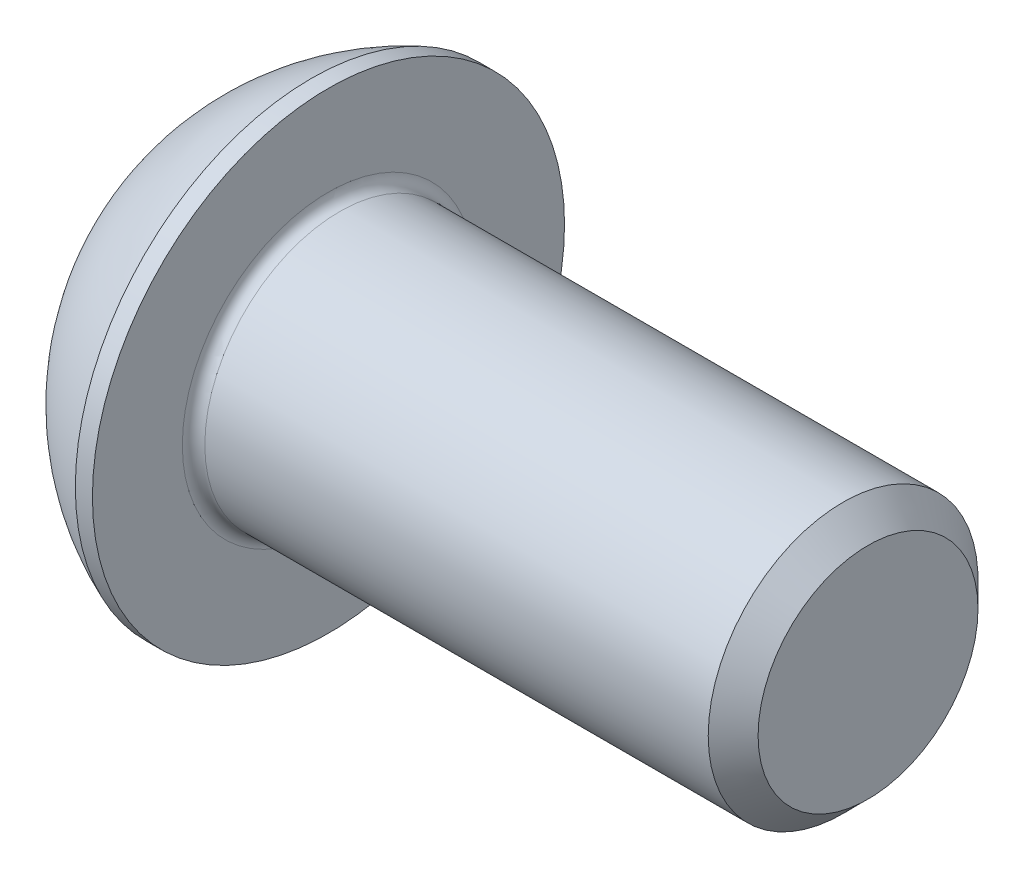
ISO-10303-21;
HEADER;
FILE_DESCRIPTION(('STEP AP214'),'2;1');
FILE_NAME('part.step','',(''),(''),'','','');
FILE_SCHEMA(('AUTOMOTIVE_DESIGN { 1 0 10303 214 1 1 1 1 }'));
ENDSEC;
DATA;
#1=APPLICATION_CONTEXT('core data for automotive mechanical design processes');
#2=APPLICATION_PROTOCOL_DEFINITION('international standard','automotive_design',2000,#1);
#3=PRODUCT_CONTEXT('',#1,'mechanical');
#4=PRODUCT('Part','Part','',(#3));
#5=PRODUCT_RELATED_PRODUCT_CATEGORY('part','',(#4));
#6=PRODUCT_DEFINITION_FORMATION('','',#4);
#7=PRODUCT_DEFINITION_CONTEXT('part definition',#1,'design');
#8=PRODUCT_DEFINITION('design','',#6,#7);
#9=PRODUCT_DEFINITION_SHAPE('','',#8);
#10=(LENGTH_UNIT() NAMED_UNIT(*) SI_UNIT(.MILLI.,.METRE.));
#11=(NAMED_UNIT(*) PLANE_ANGLE_UNIT() SI_UNIT($,.RADIAN.));
#12=(NAMED_UNIT(*) SI_UNIT($,.STERADIAN.) SOLID_ANGLE_UNIT());
#13=UNCERTAINTY_MEASURE_WITH_UNIT(LENGTH_MEASURE(1.E-05),#10,'distance_accuracy_value','');
#14=(GEOMETRIC_REPRESENTATION_CONTEXT(3) GLOBAL_UNCERTAINTY_ASSIGNED_CONTEXT((#13)) GLOBAL_UNIT_ASSIGNED_CONTEXT((#10,
#11,#12)) REPRESENTATION_CONTEXT('',''));
#15=CARTESIAN_POINT('',(0.,0.,0.));
#16=DIRECTION('',(0.,0.,1.));
#17=DIRECTION('',(1.,0.,0.));
#18=AXIS2_PLACEMENT_3D('',#15,#16,#17);
#19=CARTESIAN_POINT('',(0.,0.,0.));
#20=DIRECTION('',(-1.,0.,0.));
#21=DIRECTION('',(0.,0.,1.));
#22=AXIS2_PLACEMENT_3D('',#19,#20,#21);
#23=PLANE('',#22);
#24=CARTESIAN_POINT('',(0.,0.,0.));
#25=DIRECTION('',(-1.,0.,0.));
#26=DIRECTION('',(0.,0.,1.));
#27=AXIS2_PLACEMENT_3D('',#24,#25,#26);
#28=CIRCLE('',#27,2.625);
#29=CARTESIAN_POINT('',(0.,2.625,0.));
#30=VERTEX_POINT('',#29);
#31=EDGE_CURVE('E156',#30,#30,#28,.T.);
#32=ORIENTED_EDGE('',*,*,#31,.T.);
#33=EDGE_LOOP('',(#32));
#34=FACE_BOUND('',#33,.T.);
#35=DIRECTION('',(0.,-1.,0.));
#36=VECTOR('',#35,1.);
#37=CARTESIAN_POINT('',(0.,-1.15470053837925,2.));
#38=LINE('',#37,#36);
#39=CARTESIAN_POINT('',(0.,1.15470053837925,2.));
#40=VERTEX_POINT('',#39);
#41=CARTESIAN_POINT('',(0.,-1.15470053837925,2.));
#42=VERTEX_POINT('',#41);
#43=EDGE_CURVE('E51',#40,#42,#38,.T.);
#44=ORIENTED_EDGE('',*,*,#43,.T.);
#45=DIRECTION('',(0.,-0.499999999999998,-0.86602540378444));
#46=VECTOR('',#45,1.);
#47=CARTESIAN_POINT('',(0.,-2.3094010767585,0.));
#48=LINE('',#47,#46);
#49=CARTESIAN_POINT('',(0.,-2.3094010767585,0.));
#50=VERTEX_POINT('',#49);
#51=EDGE_CURVE('E276',#42,#50,#48,.T.);
#52=ORIENTED_EDGE('',*,*,#51,.T.);
#53=DIRECTION('',(0.,0.499999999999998,-0.86602540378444));
#54=VECTOR('',#53,1.);
#55=CARTESIAN_POINT('',(0.,-1.15470053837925,-2.));
#56=LINE('',#55,#54);
#57=CARTESIAN_POINT('',(0.,-1.15470053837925,-2.));
#58=VERTEX_POINT('',#57);
#59=EDGE_CURVE('E131',#50,#58,#56,.T.);
#60=ORIENTED_EDGE('',*,*,#59,.T.);
#61=DIRECTION('',(0.,1.,0.));
#62=VECTOR('',#61,1.);
#63=CARTESIAN_POINT('',(0.,1.15470053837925,-2.));
#64=LINE('',#63,#62);
#65=CARTESIAN_POINT('',(0.,1.15470053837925,-2.));
#66=VERTEX_POINT('',#65);
#67=EDGE_CURVE('E279',#58,#66,#64,.T.);
#68=ORIENTED_EDGE('',*,*,#67,.T.);
#69=DIRECTION('',(0.,0.499999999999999,0.866025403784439));
#70=VECTOR('',#69,1.);
#71=CARTESIAN_POINT('',(0.,2.3094010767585,0.));
#72=LINE('',#71,#70);
#73=CARTESIAN_POINT('',(0.,2.3094010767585,0.));
#74=VERTEX_POINT('',#73);
#75=EDGE_CURVE('E281',#66,#74,#72,.T.);
#76=ORIENTED_EDGE('',*,*,#75,.T.);
#77=DIRECTION('',(0.,-0.499999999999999,0.866025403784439));
#78=VECTOR('',#77,1.);
#79=CARTESIAN_POINT('',(0.,1.15470053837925,2.));
#80=LINE('',#79,#78);
#81=EDGE_CURVE('E283',#74,#40,#80,.T.);
#82=ORIENTED_EDGE('',*,*,#81,.T.);
#83=EDGE_LOOP('',(#44,#52,#60,#68,#76,#82));
#84=FACE_BOUND('',#83,.T.);
#85=ADVANCED_FACE('F36',(#34,#84),#23,.T.);
#86=CARTESIAN_POINT('',(4.99970462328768,0.,0.));
#87=DIRECTION('',(-1.,0.,0.));
#88=DIRECTION('',(0.,1.,0.));
#89=AXIS2_PLACEMENT_3D('',#86,#87,#88);
#90=SPHERICAL_SURFACE('',#89,5.64691697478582);
#91=CARTESIAN_POINT('',(2.92,0.,0.));
#92=DIRECTION('',(-1.,0.,0.));
#93=DIRECTION('',(0.,0.,1.));
#94=AXIS2_PLACEMENT_3D('',#91,#92,#93);
#95=CIRCLE('',#94,5.25);
#96=CARTESIAN_POINT('',(2.92,5.25,0.));
#97=VERTEX_POINT('',#96);
#98=EDGE_CURVE('E153',#97,#97,#95,.T.);
#99=CARTESIAN_POINT('',(2.92,5.25,0.));
#100=CARTESIAN_POINT('',(2.88116333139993,5.23461555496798,0.));
#101=CARTESIAN_POINT('',(2.84249743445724,5.21880002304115,0.));
#102=CARTESIAN_POINT('',(2.76552608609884,5.18631490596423,0.));
#103=CARTESIAN_POINT('',(2.72722063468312,5.16964532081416,0.));
#104=CARTESIAN_POINT('',(2.65098907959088,5.13546021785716,0.));
#105=CARTESIAN_POINT('',(2.61306297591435,5.11794470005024,0.));
#106=CARTESIAN_POINT('',(2.5376087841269,5.08207638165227,0.));
#107=CARTESIAN_POINT('',(2.50008069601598,5.06372358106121,0.));
#108=CARTESIAN_POINT('',(2.42544101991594,5.02618972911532,0.));
#109=CARTESIAN_POINT('',(2.38832943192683,5.00700867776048,0.));
#110=CARTESIAN_POINT('',(2.31454103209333,4.9678277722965,0.));
#111=CARTESIAN_POINT('',(2.27786422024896,4.94782791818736,0.));
#112=CARTESIAN_POINT('',(2.204963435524,4.90701925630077,0.));
#113=CARTESIAN_POINT('',(2.16873946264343,4.88621044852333,0.));
#114=CARTESIAN_POINT('',(2.09676219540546,4.84379412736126,0.));
#115=CARTESIAN_POINT('',(2.06100890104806,4.82218661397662,0.));
#116=CARTESIAN_POINT('',(1.9899905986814,4.77818352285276,0.));
#117=CARTESIAN_POINT('',(1.95472559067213,4.75578794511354,0.));
#118=CARTESIAN_POINT('',(1.88470122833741,4.71021975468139,0.));
#119=CARTESIAN_POINT('',(1.84994187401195,4.68704714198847,0.));
#120=CARTESIAN_POINT('',(1.78094593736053,4.63993629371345,0.));
#121=CARTESIAN_POINT('',(1.74670935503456,4.61599805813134,0.));
#122=CARTESIAN_POINT('',(1.67877582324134,4.56736775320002,0.));
#123=CARTESIAN_POINT('',(1.6450788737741,4.5426756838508,0.));
#124=CARTESIAN_POINT('',(1.57824120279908,4.4925498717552,0.));
#125=CARTESIAN_POINT('',(1.54510048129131,4.4671161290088,0.));
#126=CARTESIAN_POINT('',(1.4793915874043,4.4155194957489,0.));
#127=CARTESIAN_POINT('',(1.44682341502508,4.38935660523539,0.));
#128=CARTESIAN_POINT('',(1.3822756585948,4.33631456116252,0.));
#129=CARTESIAN_POINT('',(1.35029607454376,4.30943540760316,0.));
#130=CARTESIAN_POINT('',(1.28694124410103,4.2549740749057,0.));
#131=CARTESIAN_POINT('',(1.25556599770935,4.22739189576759,0.));
#132=CARTESIAN_POINT('',(1.19343529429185,4.17153809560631,0.));
#133=CARTESIAN_POINT('',(1.16267983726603,4.14326647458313,0.));
#134=CARTESIAN_POINT('',(1.10180385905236,4.0860477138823,0.));
#135=CARTESIAN_POINT('',(1.07168333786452,4.05710057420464,0.));
#136=CARTESIAN_POINT('',(1.01209206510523,3.99854503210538,0.));
#137=CARTESIAN_POINT('',(0.982621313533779,3.96893662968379,0.));
#138=CARTESIAN_POINT('',(0.924344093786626,3.90907314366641,0.));
#139=CARTESIAN_POINT('',(0.895537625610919,3.87881806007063,0.));
#140=CARTESIAN_POINT('',(0.838603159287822,3.8176761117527,0.));
#141=CARTESIAN_POINT('',(0.810475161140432,3.78678924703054,0.));
#142=CARTESIAN_POINT('',(0.754911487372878,3.72439894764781,0.));
#143=CARTESIAN_POINT('',(0.727475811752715,3.69289551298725,0.));
#144=CARTESIAN_POINT('',(0.673310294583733,3.62928758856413,0.));
#145=CARTESIAN_POINT('',(0.646580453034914,3.59718309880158,0.));
#146=CARTESIAN_POINT('',(0.593839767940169,3.53238887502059,0.));
#147=CARTESIAN_POINT('',(0.567828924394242,3.49969914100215,0.));
#148=CARTESIAN_POINT('',(0.516539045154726,3.43375052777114,0.));
#149=CARTESIAN_POINT('',(0.491260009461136,3.40049164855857,0.));
#150=CARTESIAN_POINT('',(0.441446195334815,3.33342112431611,0.));
#151=CARTESIAN_POINT('',(0.416911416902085,3.29960947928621,0.));
#152=CARTESIAN_POINT('',(0.368598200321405,3.23145007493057,0.));
#153=CARTESIAN_POINT('',(0.344819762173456,3.19710231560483,0.));
#154=CARTESIAN_POINT('',(0.298030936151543,3.12788759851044,0.));
#155=CARTESIAN_POINT('',(0.275020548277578,3.09302064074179,0.));
#156=CARTESIAN_POINT('',(0.229779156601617,3.02278469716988,0.));
#157=CARTESIAN_POINT('',(0.207548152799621,2.98741571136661,0.));
#158=CARTESIAN_POINT('',(0.163876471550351,2.91619313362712,0.));
#159=CARTESIAN_POINT('',(0.142435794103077,2.8803395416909,0.));
#160=CARTESIAN_POINT('',(0.100355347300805,2.80816539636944,0.));
#161=CARTESIAN_POINT('',(0.0797155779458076,2.7718448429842,0.));
#162=CARTESIAN_POINT('',(0.0392470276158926,2.69875470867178,0.));
#163=CARTESIAN_POINT('',(0.0194182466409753,2.66198512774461,0.));
#164=CARTESIAN_POINT('',(0.,2.625,0.));
#165=B_SPLINE_CURVE_WITH_KNOTS('',3,(#99,#100,#101,#102,#103,#104,#105,#106,#107,#108,#109,#110,
#111,#112,#113,#114,#115,#116,#117,#118,#119,#120,#121,#122,#123,#124,#125,#126,#127,#128,#129,
#130,#131,#132,#133,#134,#135,#136,#137,#138,#139,#140,#141,#142,#143,#144,#145,#146,#147,#148,
#149,#150,#151,#152,#153,#154,#155,#156,#157,#158,#159,#160,#161,#162,#163,#164),.UNSPECIFIED.,
.F.,.F.,(4,2,2,2,2,2,2,2,2,2,2,2,2,2,2,2,2,2,2,2,2,2,2,2,2,2,2,2,2,2,2,2,4),(0.,
0.12531586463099,0.25063172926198,0.37594759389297,0.501263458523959,0.626579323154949,
0.751895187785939,0.877211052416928,1.00252691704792,1.12784278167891,1.2531586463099,
1.37847451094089,1.50379037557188,1.62910624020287,1.75442210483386,1.87973796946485,
2.00505383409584,2.13036969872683,2.25568556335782,2.38100142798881,2.5063172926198,
2.63163315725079,2.75694902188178,2.88226488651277,3.00758075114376,3.13289661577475,
3.25821248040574,3.38352834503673,3.50884420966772,3.6341600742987,3.7594759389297,
3.88479180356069,4.01010766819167),.UNSPECIFIED.);
#166=EDGE_CURVE('BSEAM177',#97,#30,#165,.T.);
#167=ORIENTED_EDGE('',*,*,#98,.T.);
#168=ORIENTED_EDGE('',*,*,#31,.F.);
#169=ORIENTED_EDGE('',*,*,#166,.T.);
#170=ORIENTED_EDGE('',*,*,#166,.F.);
#171=EDGE_LOOP('',(#167,#169,#168,#170));
#172=FACE_BOUND('',#171,.T.);
#173=ADVANCED_FACE('F177',(#172),#90,.T.);
#174=CARTESIAN_POINT('',(0.,0.,0.));
#175=DIRECTION('',(-1.,0.,0.));
#176=DIRECTION('',(0.,0.,1.));
#177=AXIS2_PLACEMENT_3D('',#174,#175,#176);
#178=CYLINDRICAL_SURFACE('',#177,5.25);
#179=ORIENTED_EDGE('',*,*,#98,.F.);
#180=EDGE_LOOP('',(#179));
#181=FACE_BOUND('',#180,.T.);
#182=CARTESIAN_POINT('',(3.3,0.,0.));
#183=DIRECTION('',(-1.,0.,0.));
#184=DIRECTION('',(0.,0.,1.));
#185=AXIS2_PLACEMENT_3D('',#182,#183,#184);
#186=CIRCLE('',#185,5.25);
#187=CARTESIAN_POINT('',(3.3,0.,5.25));
#188=VERTEX_POINT('',#187);
#189=EDGE_CURVE('E150',#188,#188,#186,.T.);
#190=ORIENTED_EDGE('',*,*,#189,.T.);
#191=EDGE_LOOP('',(#190));
#192=FACE_BOUND('',#191,.T.);
#193=ADVANCED_FACE('F182',(#181,#192),#178,.T.);
#194=CARTESIAN_POINT('',(3.3,2.99999999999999,0.));
#195=DIRECTION('',(-1.,0.,0.));
#196=DIRECTION('',(0.,0.,1.));
#197=AXIS2_PLACEMENT_3D('',#194,#195,#196);
#198=PLANE('',#197);
#199=CARTESIAN_POINT('',(3.3,0.,0.));
#200=DIRECTION('',(-1.,0.,0.));
#201=DIRECTION('',(0.,0.,1.));
#202=AXIS2_PLACEMENT_3D('',#199,#200,#201);
#203=CIRCLE('',#202,3.24999999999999);
#204=CARTESIAN_POINT('',(3.3,0.,3.24999999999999));
#205=VERTEX_POINT('',#204);
#206=EDGE_CURVE('E44',#205,#205,#203,.T.);
#207=ORIENTED_EDGE('',*,*,#206,.T.);
#208=EDGE_LOOP('',(#207));
#209=FACE_BOUND('',#208,.T.);
#210=ORIENTED_EDGE('',*,*,#189,.F.);
#211=EDGE_LOOP('',(#210));
#212=FACE_BOUND('',#211,.T.);
#213=ADVANCED_FACE('F161',(#209,#212),#198,.F.);
#214=CARTESIAN_POINT('',(0.,0.,0.));
#215=DIRECTION('',(-1.,0.,0.));
#216=DIRECTION('',(0.,0.,1.));
#217=AXIS2_PLACEMENT_3D('',#214,#215,#216);
#218=CYLINDRICAL_SURFACE('',#217,2.99999999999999);
#219=CARTESIAN_POINT('',(3.55,0.,0.));
#220=DIRECTION('',(-1.,0.,0.));
#221=DIRECTION('',(0.,0.,1.));
#222=AXIS2_PLACEMENT_3D('',#219,#220,#221);
#223=CIRCLE('',#222,2.99999999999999);
#224=CARTESIAN_POINT('',(3.55,0.,2.99999999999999));
#225=VERTEX_POINT('',#224);
#226=EDGE_CURVE('E11',#225,#225,#223,.F.);
#227=ORIENTED_EDGE('',*,*,#226,.T.);
#228=EDGE_LOOP('',(#227));
#229=FACE_BOUND('',#228,.T.);
#230=CARTESIAN_POINT('',(14.7455,0.,0.));
#231=DIRECTION('',(-1.,0.,0.));
#232=DIRECTION('',(0.,0.,1.));
#233=AXIS2_PLACEMENT_3D('',#230,#231,#232);
#234=CIRCLE('',#233,3.);
#235=CARTESIAN_POINT('',(14.7455,0.,3.));
#236=VERTEX_POINT('',#235);
#237=EDGE_CURVE('E147',#236,#236,#234,.T.);
#238=ORIENTED_EDGE('',*,*,#237,.T.);
#239=EDGE_LOOP('',(#238));
#240=FACE_BOUND('',#239,.T.);
#241=ADVANCED_FACE('F191',(#229,#240),#218,.T.);
#242=CARTESIAN_POINT('',(15.3,0.,0.));
#243=DIRECTION('',(-1.,0.,0.));
#244=DIRECTION('',(0.,0.,1.));
#245=AXIS2_PLACEMENT_3D('',#242,#243,#244);
#246=CONICAL_SURFACE('',#245,2.4455,0.785398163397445);
#247=ORIENTED_EDGE('',*,*,#237,.F.);
#248=EDGE_LOOP('',(#247));
#249=FACE_BOUND('',#248,.T.);
#250=CARTESIAN_POINT('',(15.3,0.,0.));
#251=DIRECTION('',(-1.,0.,0.));
#252=DIRECTION('',(0.,0.,1.));
#253=AXIS2_PLACEMENT_3D('',#250,#251,#252);
#254=CIRCLE('',#253,2.4455);
#255=CARTESIAN_POINT('',(15.3,0.,2.4455));
#256=VERTEX_POINT('',#255);
#257=EDGE_CURVE('E143',#256,#256,#254,.T.);
#258=ORIENTED_EDGE('',*,*,#257,.T.);
#259=EDGE_LOOP('',(#258));
#260=FACE_BOUND('',#259,.T.);
#261=ADVANCED_FACE('F172',(#249,#260),#246,.T.);
#262=CARTESIAN_POINT('',(15.3,0.,0.));
#263=DIRECTION('',(-1.,0.,0.));
#264=DIRECTION('',(0.,0.,1.));
#265=AXIS2_PLACEMENT_3D('',#262,#263,#264);
#266=PLANE('',#265);
#267=ORIENTED_EDGE('',*,*,#257,.F.);
#268=EDGE_LOOP('',(#267));
#269=FACE_BOUND('',#268,.T.);
#270=ADVANCED_FACE('F165',(#269),#266,.F.);
#271=CARTESIAN_POINT('',(3.55,0.,0.));
#272=DIRECTION('',(-1.,0.,0.));
#273=DIRECTION('',(0.,0.,1.));
#274=AXIS2_PLACEMENT_3D('',#271,#272,#273);
#275=TOROIDAL_SURFACE('',#274,3.24999999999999,0.25);
#276=ORIENTED_EDGE('',*,*,#226,.F.);
#277=EDGE_LOOP('',(#276));
#278=FACE_BOUND('',#277,.T.);
#279=ORIENTED_EDGE('',*,*,#206,.F.);
#280=EDGE_LOOP('',(#279));
#281=FACE_BOUND('',#280,.T.);
#282=ADVANCED_FACE('F38',(#278,#281),#275,.F.);
#283=CARTESIAN_POINT('',(2.08,-2.3094010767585,0.));
#284=DIRECTION('',(0.,0.86602540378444,-0.499999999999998));
#285=DIRECTION('',(0.,0.499999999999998,0.86602540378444));
#286=AXIS2_PLACEMENT_3D('',#283,#284,#285);
#287=PLANE('',#286);
#288=DIRECTION('',(0.,-0.499999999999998,-0.86602540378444));
#289=VECTOR('',#288,1.);
#290=CARTESIAN_POINT('',(2.08,-2.3094010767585,0.));
#291=LINE('',#290,#289);
#292=CARTESIAN_POINT('',(2.08,-1.15470053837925,2.));
#293=VERTEX_POINT('',#292);
#294=CARTESIAN_POINT('',(2.08,-1.73205080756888,0.999999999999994));
#295=VERTEX_POINT('',#294);
#296=EDGE_CURVE('E117',#293,#295,#291,.T.);
#297=ORIENTED_EDGE('',*,*,#296,.T.);
#298=CARTESIAN_POINT('',(2.08,-2.3094010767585,0.));
#299=VERTEX_POINT('',#298);
#300=EDGE_CURVE('E112',#295,#299,#291,.T.);
#301=ORIENTED_EDGE('',*,*,#300,.T.);
#302=DIRECTION('',(-1.,0.,0.));
#303=VECTOR('',#302,1.);
#304=CARTESIAN_POINT('',(2.08,-2.3094010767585,0.));
#305=LINE('',#304,#303);
#306=EDGE_CURVE('E114',#299,#50,#305,.T.);
#307=ORIENTED_EDGE('',*,*,#306,.T.);
#308=ORIENTED_EDGE('',*,*,#51,.F.);
#309=DIRECTION('',(-1.,0.,0.));
#310=VECTOR('',#309,1.);
#311=CARTESIAN_POINT('',(2.08,-1.15470053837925,2.));
#312=LINE('',#311,#310);
#313=EDGE_CURVE('E272',#293,#42,#312,.T.);
#314=ORIENTED_EDGE('',*,*,#313,.F.);
#315=EDGE_LOOP('',(#297,#301,#307,#308,#314));
#316=FACE_BOUND('',#315,.T.);
#317=ADVANCED_FACE('F113',(#316),#287,.T.);
#318=CARTESIAN_POINT('',(2.08,-1.15470053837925,-2.));
#319=DIRECTION('',(0.,0.86602540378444,0.499999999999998));
#320=DIRECTION('',(0.,-0.499999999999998,0.86602540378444));
#321=AXIS2_PLACEMENT_3D('',#318,#319,#320);
#322=PLANE('',#321);
#323=DIRECTION('',(0.,0.499999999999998,-0.86602540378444));
#324=VECTOR('',#323,1.);
#325=CARTESIAN_POINT('',(2.08,-1.15470053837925,-2.));
#326=LINE('',#325,#324);
#327=CARTESIAN_POINT('',(2.08,-1.73205080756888,-0.999999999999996));
#328=VERTEX_POINT('',#327);
#329=EDGE_CURVE('E59',#299,#328,#326,.T.);
#330=ORIENTED_EDGE('',*,*,#329,.T.);
#331=CARTESIAN_POINT('',(2.08,-1.15470053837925,-2.));
#332=VERTEX_POINT('',#331);
#333=EDGE_CURVE('E126',#328,#332,#326,.T.);
#334=ORIENTED_EDGE('',*,*,#333,.T.);
#335=DIRECTION('',(-1.,0.,0.));
#336=VECTOR('',#335,1.);
#337=CARTESIAN_POINT('',(2.08,-1.15470053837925,-2.));
#338=LINE('',#337,#336);
#339=EDGE_CURVE('E133',#332,#58,#338,.T.);
#340=ORIENTED_EDGE('',*,*,#339,.T.);
#341=ORIENTED_EDGE('',*,*,#59,.F.);
#342=ORIENTED_EDGE('',*,*,#306,.F.);
#343=EDGE_LOOP('',(#330,#334,#340,#341,#342));
#344=FACE_BOUND('',#343,.T.);
#345=ADVANCED_FACE('F129',(#344),#322,.T.);
#346=CARTESIAN_POINT('',(2.08,1.15470053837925,-2.));
#347=DIRECTION('',(0.,0.,1.));
#348=DIRECTION('',(0.,-1.,0.));
#349=AXIS2_PLACEMENT_3D('',#346,#347,#348);
#350=PLANE('',#349);
#351=DIRECTION('',(0.,1.,0.));
#352=VECTOR('',#351,1.);
#353=CARTESIAN_POINT('',(2.08,1.15470053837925,-2.));
#354=LINE('',#353,#352);
#355=CARTESIAN_POINT('',(2.08,0.,-2.));
#356=VERTEX_POINT('',#355);
#357=EDGE_CURVE('E253',#332,#356,#354,.T.);
#358=ORIENTED_EDGE('',*,*,#357,.T.);
#359=CARTESIAN_POINT('',(2.08,1.15470053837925,-2.));
#360=VERTEX_POINT('',#359);
#361=EDGE_CURVE('E125',#356,#360,#354,.T.);
#362=ORIENTED_EDGE('',*,*,#361,.T.);
#363=DIRECTION('',(-1.,0.,0.));
#364=VECTOR('',#363,1.);
#365=CARTESIAN_POINT('',(2.08,1.15470053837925,-2.));
#366=LINE('',#365,#364);
#367=EDGE_CURVE('E138',#360,#66,#366,.T.);
#368=ORIENTED_EDGE('',*,*,#367,.T.);
#369=ORIENTED_EDGE('',*,*,#67,.F.);
#370=ORIENTED_EDGE('',*,*,#339,.F.);
#371=EDGE_LOOP('',(#358,#362,#368,#369,#370));
#372=FACE_BOUND('',#371,.T.);
#373=ADVANCED_FACE('F205',(#372),#350,.T.);
#374=CARTESIAN_POINT('',(2.08,2.3094010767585,0.));
#375=DIRECTION('',(0.,-0.866025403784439,0.499999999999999));
#376=DIRECTION('',(0.,-0.499999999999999,-0.866025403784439));
#377=AXIS2_PLACEMENT_3D('',#374,#375,#376);
#378=PLANE('',#377);
#379=DIRECTION('',(0.,0.499999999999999,0.866025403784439));
#380=VECTOR('',#379,1.);
#381=CARTESIAN_POINT('',(2.08,2.3094010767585,0.));
#382=LINE('',#381,#380);
#383=CARTESIAN_POINT('',(2.08,1.73205080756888,-0.999999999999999));
#384=VERTEX_POINT('',#383);
#385=EDGE_CURVE('E242',#360,#384,#382,.T.);
#386=ORIENTED_EDGE('',*,*,#385,.T.);
#387=CARTESIAN_POINT('',(2.08,2.3094010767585,0.));
#388=VERTEX_POINT('',#387);
#389=EDGE_CURVE('E247',#384,#388,#382,.T.);
#390=ORIENTED_EDGE('',*,*,#389,.T.);
#391=DIRECTION('',(-1.,0.,0.));
#392=VECTOR('',#391,1.);
#393=CARTESIAN_POINT('',(2.08,2.3094010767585,0.));
#394=LINE('',#393,#392);
#395=EDGE_CURVE('E287',#388,#74,#394,.T.);
#396=ORIENTED_EDGE('',*,*,#395,.T.);
#397=ORIENTED_EDGE('',*,*,#75,.F.);
#398=ORIENTED_EDGE('',*,*,#367,.F.);
#399=EDGE_LOOP('',(#386,#390,#396,#397,#398));
#400=FACE_BOUND('',#399,.T.);
#401=ADVANCED_FACE('F208',(#400),#378,.T.);
#402=CARTESIAN_POINT('',(2.08,1.15470053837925,2.));
#403=DIRECTION('',(0.,-0.866025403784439,-0.499999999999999));
#404=DIRECTION('',(0.,0.499999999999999,-0.866025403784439));
#405=AXIS2_PLACEMENT_3D('',#402,#403,#404);
#406=PLANE('',#405);
#407=DIRECTION('',(0.,-0.499999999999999,0.866025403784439));
#408=VECTOR('',#407,1.);
#409=CARTESIAN_POINT('',(2.08,1.15470053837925,2.));
#410=LINE('',#409,#408);
#411=CARTESIAN_POINT('',(2.08,1.73205080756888,0.999999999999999));
#412=VERTEX_POINT('',#411);
#413=EDGE_CURVE('E250',#388,#412,#410,.T.);
#414=ORIENTED_EDGE('',*,*,#413,.T.);
#415=CARTESIAN_POINT('',(2.08,1.15470053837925,2.));
#416=VERTEX_POINT('',#415);
#417=EDGE_CURVE('E258',#412,#416,#410,.T.);
#418=ORIENTED_EDGE('',*,*,#417,.T.);
#419=DIRECTION('',(-1.,0.,0.));
#420=VECTOR('',#419,1.);
#421=CARTESIAN_POINT('',(2.08,1.15470053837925,2.));
#422=LINE('',#421,#420);
#423=EDGE_CURVE('E271',#416,#40,#422,.T.);
#424=ORIENTED_EDGE('',*,*,#423,.T.);
#425=ORIENTED_EDGE('',*,*,#81,.F.);
#426=ORIENTED_EDGE('',*,*,#395,.F.);
#427=EDGE_LOOP('',(#414,#418,#424,#425,#426));
#428=FACE_BOUND('',#427,.T.);
#429=ADVANCED_FACE('F212',(#428),#406,.T.);
#430=CARTESIAN_POINT('',(2.08,-1.15470053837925,2.));
#431=DIRECTION('',(0.,0.,-1.));
#432=DIRECTION('',(0.,1.,0.));
#433=AXIS2_PLACEMENT_3D('',#430,#431,#432);
#434=PLANE('',#433);
#435=DIRECTION('',(0.,-1.,0.));
#436=VECTOR('',#435,1.);
#437=CARTESIAN_POINT('',(2.08,-1.15470053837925,2.));
#438=LINE('',#437,#436);
#439=CARTESIAN_POINT('',(2.08,0.,2.));
#440=VERTEX_POINT('',#439);
#441=EDGE_CURVE('E264',#416,#440,#438,.T.);
#442=ORIENTED_EDGE('',*,*,#441,.T.);
#443=EDGE_CURVE('E266',#440,#293,#438,.T.);
#444=ORIENTED_EDGE('',*,*,#443,.T.);
#445=ORIENTED_EDGE('',*,*,#313,.T.);
#446=ORIENTED_EDGE('',*,*,#43,.F.);
#447=ORIENTED_EDGE('',*,*,#423,.F.);
#448=EDGE_LOOP('',(#442,#444,#445,#446,#447));
#449=FACE_BOUND('',#448,.T.);
#450=ADVANCED_FACE('F216',(#449),#434,.T.);
#451=CARTESIAN_POINT('',(2.08,-3.46410161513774,-2.));
#452=DIRECTION('',(1.,0.,0.));
#453=DIRECTION('',(0.,0.,-1.));
#454=AXIS2_PLACEMENT_3D('',#451,#452,#453);
#455=PLANE('',#454);
#456=CARTESIAN_POINT('',(2.08,0.,0.));
#457=DIRECTION('',(-1.,0.,0.));
#458=DIRECTION('',(0.,0.,1.));
#459=AXIS2_PLACEMENT_3D('',#456,#457,#458);
#460=CIRCLE('',#459,2.);
#461=EDGE_CURVE('E239',#384,#356,#460,.T.);
#462=ORIENTED_EDGE('',*,*,#461,.F.);
#463=ORIENTED_EDGE('',*,*,#385,.F.);
#464=ORIENTED_EDGE('',*,*,#361,.F.);
#465=EDGE_LOOP('',(#462,#463,#464));
#466=FACE_BOUND('',#465,.T.);
#467=ADVANCED_FACE('F220',(#466),#455,.F.);
#468=EDGE_CURVE('E144',#412,#384,#460,.T.);
#469=ORIENTED_EDGE('',*,*,#468,.F.);
#470=ORIENTED_EDGE('',*,*,#413,.F.);
#471=ORIENTED_EDGE('',*,*,#389,.F.);
#472=EDGE_LOOP('',(#469,#470,#471));
#473=FACE_BOUND('',#472,.T.);
#474=ADVANCED_FACE('F229',(#473),#455,.F.);
#475=EDGE_CURVE('E137',#440,#412,#460,.T.);
#476=ORIENTED_EDGE('',*,*,#475,.F.);
#477=ORIENTED_EDGE('',*,*,#441,.F.);
#478=ORIENTED_EDGE('',*,*,#417,.F.);
#479=EDGE_LOOP('',(#476,#477,#478));
#480=FACE_BOUND('',#479,.T.);
#481=ADVANCED_FACE('F234',(#480),#455,.F.);
#482=EDGE_CURVE('E132',#295,#440,#460,.T.);
#483=ORIENTED_EDGE('',*,*,#482,.F.);
#484=ORIENTED_EDGE('',*,*,#296,.F.);
#485=ORIENTED_EDGE('',*,*,#443,.F.);
#486=EDGE_LOOP('',(#483,#484,#485));
#487=FACE_BOUND('',#486,.T.);
#488=ADVANCED_FACE('F227',(#487),#455,.F.);
#489=EDGE_CURVE('E123',#328,#295,#460,.T.);
#490=ORIENTED_EDGE('',*,*,#489,.F.);
#491=ORIENTED_EDGE('',*,*,#329,.F.);
#492=ORIENTED_EDGE('',*,*,#300,.F.);
#493=EDGE_LOOP('',(#490,#491,#492));
#494=FACE_BOUND('',#493,.T.);
#495=ADVANCED_FACE('F122',(#494),#455,.F.);
#496=EDGE_CURVE('E245',#356,#328,#460,.T.);
#497=ORIENTED_EDGE('',*,*,#496,.F.);
#498=ORIENTED_EDGE('',*,*,#357,.F.);
#499=ORIENTED_EDGE('',*,*,#333,.F.);
#500=EDGE_LOOP('',(#497,#498,#499));
#501=FACE_BOUND('',#500,.T.);
#502=ADVANCED_FACE('F200',(#501),#455,.F.);
#503=CARTESIAN_POINT('',(3.23470053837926,0.,0.));
#504=DIRECTION('',(-1.,0.,0.));
#505=DIRECTION('',(0.,0.,1.));
#506=AXIS2_PLACEMENT_3D('',#503,#504,#505);
#507=CONICAL_SURFACE('',#506,0.,1.04719755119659);
#508=ORIENTED_EDGE('',*,*,#475,.T.);
#509=ORIENTED_EDGE('',*,*,#468,.T.);
#510=ORIENTED_EDGE('',*,*,#461,.T.);
#511=ORIENTED_EDGE('',*,*,#496,.T.);
#512=ORIENTED_EDGE('',*,*,#489,.T.);
#513=ORIENTED_EDGE('',*,*,#482,.T.);
#514=EDGE_LOOP('',(#508,#509,#510,#511,#512,#513));
#515=FACE_BOUND('',#514,.T.);
#516=CARTESIAN_POINT('',(3.23470053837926,0.,0.));
#517=VERTEX_POINT('',#516);
#518=VERTEX_LOOP('',#517);
#519=FACE_BOUND('',#518,.T.);
#520=ADVANCED_FACE('F198',(#515,#519),#507,.F.);
#521=CLOSED_SHELL('',(#85,#173,#193,#213,#241,#261,#270,#282,#317,#345,#373,#401,#429,#450,#467,
#474,#481,#488,#495,#502,#520));
#522=MANIFOLD_SOLID_BREP('B2',#521);
#523=ADVANCED_BREP_SHAPE_REPRESENTATION('',(#18,#522),#14);
#524=SHAPE_DEFINITION_REPRESENTATION(#9,#523);
ENDSEC;
END-ISO-10303-21;
